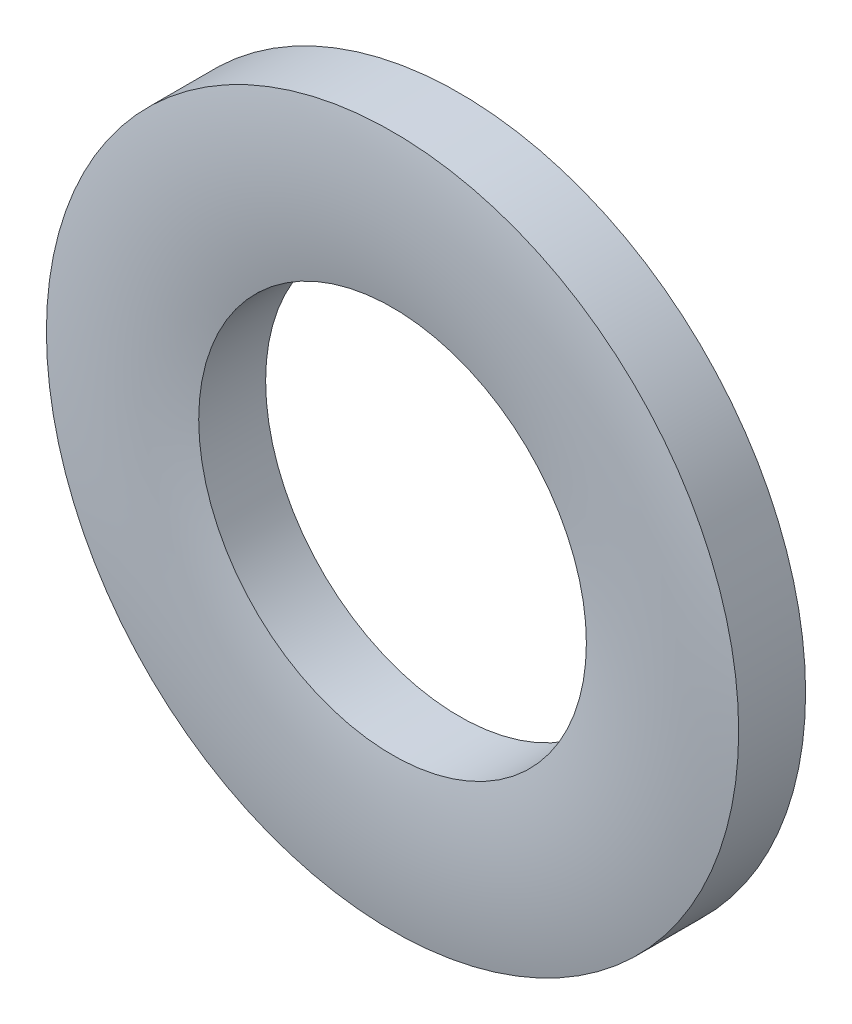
from build123d import *


with BuildPart() as part:
    # Sketch3 → Revolve1 (revolve)
    with BuildSketch(Plane(origin=(0, 0, 0), x_dir=(0, 0, -1), z_dir=(1, 0, 0)), mode=Mode.PRIVATE) as revolve1_sk:
        with BuildLine():
            Line((0.8, 7.5), (-0.65008, 7.5))
            ThreePointArc((-0.65008, 7.5), (-0.8, 5.85), (-0.65008, 4.2))
            Line((-0.65008, 4.2), (0.8, 4.2))
            Line((0.8, 4.2), (0.8, 7.5))
        make_face()
    revolve(revolve1_sk.sketch.rotate(Axis((0, 0, 0.8), (0, 0, -1)), 90), axis=Axis((0, 0, 0.8), (0, 0, -1)))


solid = part.part
